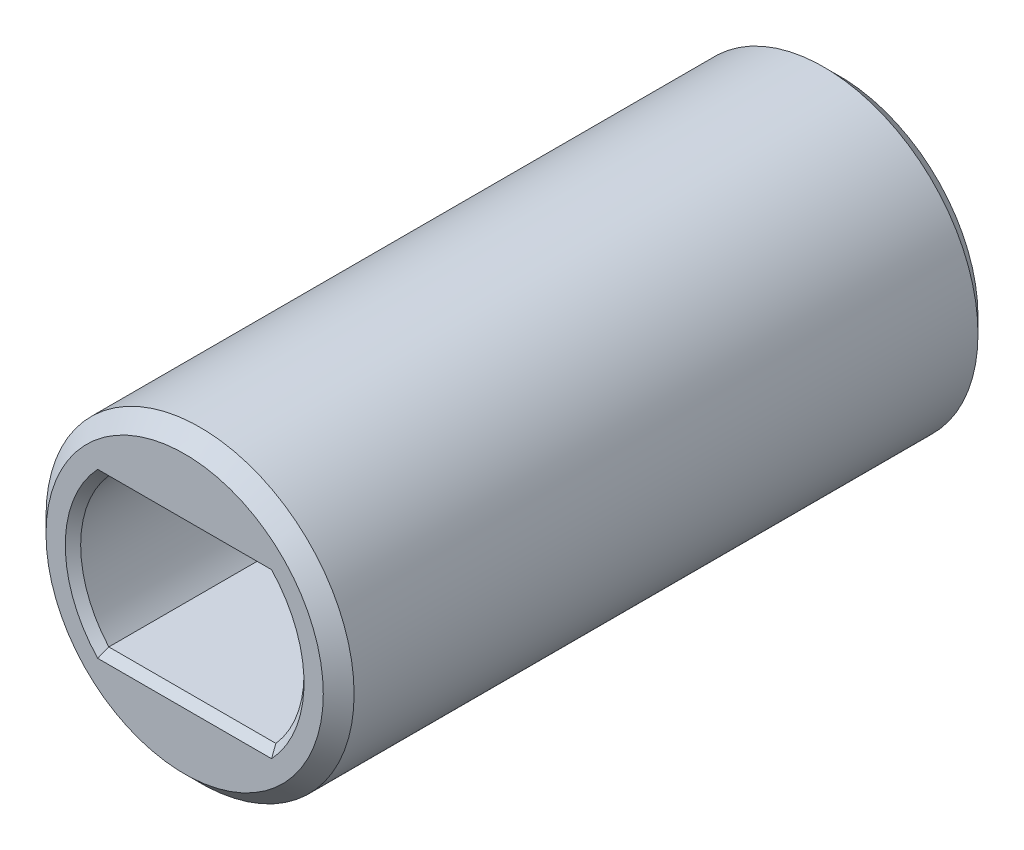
ISO-10303-21;
HEADER;
FILE_DESCRIPTION(('STEP AP214'),'2;1');
FILE_NAME('part.step','',(''),(''),'','','');
FILE_SCHEMA(('AUTOMOTIVE_DESIGN { 1 0 10303 214 1 1 1 1 }'));
ENDSEC;
DATA;
#1=APPLICATION_CONTEXT('core data for automotive mechanical design processes');
#2=APPLICATION_PROTOCOL_DEFINITION('international standard','automotive_design',2000,#1);
#3=PRODUCT_CONTEXT('',#1,'mechanical');
#4=PRODUCT('Part','Part','',(#3));
#5=PRODUCT_RELATED_PRODUCT_CATEGORY('part','',(#4));
#6=PRODUCT_DEFINITION_FORMATION('','',#4);
#7=PRODUCT_DEFINITION_CONTEXT('part definition',#1,'design');
#8=PRODUCT_DEFINITION('design','',#6,#7);
#9=PRODUCT_DEFINITION_SHAPE('','',#8);
#10=(LENGTH_UNIT() NAMED_UNIT(*) SI_UNIT(.MILLI.,.METRE.));
#11=(NAMED_UNIT(*) PLANE_ANGLE_UNIT() SI_UNIT($,.RADIAN.));
#12=(NAMED_UNIT(*) SI_UNIT($,.STERADIAN.) SOLID_ANGLE_UNIT());
#13=UNCERTAINTY_MEASURE_WITH_UNIT(LENGTH_MEASURE(1.E-05),#10,'distance_accuracy_value','');
#14=(GEOMETRIC_REPRESENTATION_CONTEXT(3) GLOBAL_UNCERTAINTY_ASSIGNED_CONTEXT((#13)) GLOBAL_UNIT_ASSIGNED_CONTEXT((#10,
#11,#12)) REPRESENTATION_CONTEXT('',''));
#15=CARTESIAN_POINT('',(0.,0.,0.));
#16=DIRECTION('',(0.,0.,1.));
#17=DIRECTION('',(1.,0.,0.));
#18=AXIS2_PLACEMENT_3D('',#15,#16,#17);
#19=CARTESIAN_POINT('',(0.,0.,-1.6));
#20=DIRECTION('',(0.,0.,-1.));
#21=DIRECTION('',(-1.,0.,0.));
#22=AXIS2_PLACEMENT_3D('',#19,#20,#21);
#23=CYLINDRICAL_SURFACE('',#22,1.9);
#24=CARTESIAN_POINT('',(0.,0.,-8.4));
#25=DIRECTION('',(0.,0.,-1.));
#26=DIRECTION('',(-1.,0.,0.));
#27=AXIS2_PLACEMENT_3D('',#24,#25,#26);
#28=CIRCLE('',#27,1.9);
#29=CARTESIAN_POINT('',(-1.9,0.,-8.4));
#30=VERTEX_POINT('',#29);
#31=EDGE_CURVE('E180',#30,#30,#28,.T.);
#32=ORIENTED_EDGE('',*,*,#31,.T.);
#33=EDGE_LOOP('',(#32));
#34=FACE_BOUND('',#33,.T.);
#35=DIRECTION('',(0.,0.,1.));
#36=VECTOR('',#35,1.);
#37=CARTESIAN_POINT('',(-1.54919333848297,-1.1,-6.8));
#38=LINE('',#37,#36);
#39=CARTESIAN_POINT('',(-1.54919333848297,-1.1,-6.8));
#40=VERTEX_POINT('',#39);
#41=CARTESIAN_POINT('',(-1.54919333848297,-1.1,-1.6));
#42=VERTEX_POINT('',#41);
#43=EDGE_CURVE('E47',#40,#42,#38,.T.);
#44=ORIENTED_EDGE('',*,*,#43,.F.);
#45=CARTESIAN_POINT('',(0.,0.,-6.8));
#46=DIRECTION('',(0.,0.,-1.));
#47=DIRECTION('',(-1.,0.,0.));
#48=AXIS2_PLACEMENT_3D('',#45,#46,#47);
#49=CIRCLE('',#48,1.9);
#50=CARTESIAN_POINT('',(1.54919333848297,-1.1,-6.8));
#51=VERTEX_POINT('',#50);
#52=EDGE_CURVE('E115',#51,#40,#49,.T.);
#53=ORIENTED_EDGE('',*,*,#52,.F.);
#54=DIRECTION('',(0.,0.,1.));
#55=VECTOR('',#54,1.);
#56=CARTESIAN_POINT('',(1.54919333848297,-1.1,-6.8));
#57=LINE('',#56,#55);
#58=CARTESIAN_POINT('',(1.54919333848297,-1.1,-1.6));
#59=VERTEX_POINT('',#58);
#60=EDGE_CURVE('E112',#51,#59,#57,.T.);
#61=ORIENTED_EDGE('',*,*,#60,.T.);
#62=CARTESIAN_POINT('',(0.,0.,-1.6));
#63=DIRECTION('',(0.,0.,-1.));
#64=DIRECTION('',(-1.,0.,0.));
#65=AXIS2_PLACEMENT_3D('',#62,#63,#64);
#66=CIRCLE('',#65,1.9);
#67=CARTESIAN_POINT('',(1.54919333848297,1.1,-1.6));
#68=VERTEX_POINT('',#67);
#69=EDGE_CURVE('E139',#68,#59,#66,.T.);
#70=ORIENTED_EDGE('',*,*,#69,.F.);
#71=DIRECTION('',(0.,0.,1.));
#72=VECTOR('',#71,1.);
#73=CARTESIAN_POINT('',(1.54919333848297,1.1,-6.8));
#74=LINE('',#73,#72);
#75=CARTESIAN_POINT('',(1.54919333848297,1.1,-6.8));
#76=VERTEX_POINT('',#75);
#77=EDGE_CURVE('E55',#76,#68,#74,.T.);
#78=ORIENTED_EDGE('',*,*,#77,.F.);
#79=CARTESIAN_POINT('',(0.,0.,-6.8));
#80=DIRECTION('',(0.,0.,-1.));
#81=DIRECTION('',(-1.,0.,0.));
#82=AXIS2_PLACEMENT_3D('',#79,#80,#81);
#83=CIRCLE('',#82,1.9);
#84=CARTESIAN_POINT('',(-1.54919333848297,1.1,-6.8));
#85=VERTEX_POINT('',#84);
#86=EDGE_CURVE('E126',#85,#76,#83,.T.);
#87=ORIENTED_EDGE('',*,*,#86,.F.);
#88=DIRECTION('',(0.,0.,1.));
#89=VECTOR('',#88,1.);
#90=CARTESIAN_POINT('',(-1.54919333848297,1.1,-6.8));
#91=LINE('',#90,#89);
#92=CARTESIAN_POINT('',(-1.54919333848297,1.1,-1.6));
#93=VERTEX_POINT('',#92);
#94=EDGE_CURVE('E134',#85,#93,#91,.T.);
#95=ORIENTED_EDGE('',*,*,#94,.T.);
#96=EDGE_CURVE('E123',#42,#93,#66,.T.);
#97=ORIENTED_EDGE('',*,*,#96,.F.);
#98=EDGE_LOOP('',(#44,#53,#61,#70,#78,#87,#95,#97));
#99=FACE_BOUND('',#98,.T.);
#100=ADVANCED_FACE('F32',(#34,#99),#23,.F.);
#101=CARTESIAN_POINT('',(0.,0.,-1.6));
#102=DIRECTION('',(0.,0.,-1.));
#103=DIRECTION('',(-1.,0.,0.));
#104=AXIS2_PLACEMENT_3D('',#101,#102,#103);
#105=PLANE('',#104);
#106=ORIENTED_EDGE('',*,*,#69,.T.);
#107=DIRECTION('',(1.,0.,0.));
#108=VECTOR('',#107,1.);
#109=CARTESIAN_POINT('',(1.54919333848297,-1.1,-1.6));
#110=LINE('',#109,#108);
#111=EDGE_CURVE('E119',#42,#59,#110,.T.);
#112=ORIENTED_EDGE('',*,*,#111,.F.);
#113=ORIENTED_EDGE('',*,*,#96,.T.);
#114=DIRECTION('',(-1.,0.,0.));
#115=VECTOR('',#114,1.);
#116=CARTESIAN_POINT('',(1.54919333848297,1.1,-1.6));
#117=LINE('',#116,#115);
#118=EDGE_CURVE('E124',#68,#93,#117,.T.);
#119=ORIENTED_EDGE('',*,*,#118,.F.);
#120=EDGE_LOOP('',(#106,#112,#113,#119));
#121=FACE_BOUND('',#120,.T.);
#122=ADVANCED_FACE('F242',(#121),#105,.T.);
#123=CARTESIAN_POINT('',(0.,0.,8.4));
#124=DIRECTION('',(0.,0.,1.));
#125=DIRECTION('',(1.,0.,0.));
#126=AXIS2_PLACEMENT_3D('',#123,#124,#125);
#127=PLANE('',#126);
#128=CARTESIAN_POINT('',(0.,0.,8.4));
#129=DIRECTION('',(0.,0.,1.));
#130=DIRECTION('',(1.,0.,0.));
#131=AXIS2_PLACEMENT_3D('',#128,#129,#130);
#132=CIRCLE('',#131,3.60000000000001);
#133=CARTESIAN_POINT('',(3.60000000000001,0.,8.4));
#134=VERTEX_POINT('',#133);
#135=EDGE_CURVE('E11',#134,#134,#132,.T.);
#136=ORIENTED_EDGE('',*,*,#135,.T.);
#137=EDGE_LOOP('',(#136));
#138=FACE_BOUND('',#137,.T.);
#139=DIRECTION('',(1.,0.,0.));
#140=VECTOR('',#139,1.);
#141=CARTESIAN_POINT('',(0.,2.125,8.4));
#142=LINE('',#141,#140);
#143=CARTESIAN_POINT('',(-2.25707221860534,2.125,8.4));
#144=VERTEX_POINT('',#143);
#145=CARTESIAN_POINT('',(2.25707221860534,2.125,8.4));
#146=VERTEX_POINT('',#145);
#147=EDGE_CURVE('E167',#144,#146,#142,.T.);
#148=ORIENTED_EDGE('',*,*,#147,.T.);
#149=CARTESIAN_POINT('',(0.,0.,8.4));
#150=DIRECTION('',(0.,0.,1.));
#151=DIRECTION('',(1.,0.,0.));
#152=AXIS2_PLACEMENT_3D('',#149,#150,#151);
#153=CIRCLE('',#152,3.10000000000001);
#154=CARTESIAN_POINT('',(2.25707221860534,-2.12500000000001,8.4));
#155=VERTEX_POINT('',#154);
#156=EDGE_CURVE('E171',#146,#155,#153,.F.);
#157=ORIENTED_EDGE('',*,*,#156,.T.);
#158=DIRECTION('',(-1.,0.,0.));
#159=VECTOR('',#158,1.);
#160=CARTESIAN_POINT('',(0.,-2.12500000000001,8.4));
#161=LINE('',#160,#159);
#162=CARTESIAN_POINT('',(-2.25707221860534,-2.125,8.4));
#163=VERTEX_POINT('',#162);
#164=EDGE_CURVE('E169',#155,#163,#161,.T.);
#165=ORIENTED_EDGE('',*,*,#164,.T.);
#166=CARTESIAN_POINT('',(0.,0.,8.4));
#167=DIRECTION('',(0.,0.,1.));
#168=DIRECTION('',(1.,0.,0.));
#169=AXIS2_PLACEMENT_3D('',#166,#167,#168);
#170=CIRCLE('',#169,3.1);
#171=EDGE_CURVE('E165',#163,#144,#170,.F.);
#172=ORIENTED_EDGE('',*,*,#171,.T.);
#173=EDGE_LOOP('',(#148,#157,#165,#172));
#174=FACE_BOUND('',#173,.T.);
#175=ADVANCED_FACE('F248',(#138,#174),#127,.T.);
#176=CARTESIAN_POINT('',(0.,0.,8.4));
#177=DIRECTION('',(0.,0.,-1.));
#178=DIRECTION('',(-1.,0.,0.));
#179=AXIS2_PLACEMENT_3D('',#176,#177,#178);
#180=CYLINDRICAL_SURFACE('',#179,4.);
#181=CARTESIAN_POINT('',(0.,0.,-8.2));
#182=DIRECTION('',(0.,0.,-1.));
#183=DIRECTION('',(-1.,0.,0.));
#184=AXIS2_PLACEMENT_3D('',#181,#182,#183);
#185=CIRCLE('',#184,4.);
#186=CARTESIAN_POINT('',(-4.,0.,-8.2));
#187=VERTEX_POINT('',#186);
#188=EDGE_CURVE('E40',#187,#187,#185,.F.);
#189=ORIENTED_EDGE('',*,*,#188,.T.);
#190=EDGE_LOOP('',(#189));
#191=FACE_BOUND('',#190,.T.);
#192=CARTESIAN_POINT('',(0.,0.,8.));
#193=DIRECTION('',(0.,0.,1.));
#194=DIRECTION('',(1.,0.,0.));
#195=AXIS2_PLACEMENT_3D('',#192,#193,#194);
#196=CIRCLE('',#195,4.);
#197=CARTESIAN_POINT('',(4.,0.,8.));
#198=VERTEX_POINT('',#197);
#199=EDGE_CURVE('E287',#198,#198,#196,.F.);
#200=ORIENTED_EDGE('',*,*,#199,.T.);
#201=EDGE_LOOP('',(#200));
#202=FACE_BOUND('',#201,.T.);
#203=ADVANCED_FACE('F275',(#191,#202),#180,.T.);
#204=CARTESIAN_POINT('',(0.,0.,8.4));
#205=DIRECTION('',(0.,0.,-1.));
#206=DIRECTION('',(-1.,0.,0.));
#207=AXIS2_PLACEMENT_3D('',#204,#205,#206);
#208=CYLINDRICAL_SURFACE('',#207,2.9);
#209=DIRECTION('',(0.,0.,-1.));
#210=VECTOR('',#209,1.);
#211=CARTESIAN_POINT('',(-2.1689571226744,1.925,8.4));
#212=LINE('',#211,#210);
#213=CARTESIAN_POINT('',(-2.1689571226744,1.925,8.2));
#214=VERTEX_POINT('',#213);
#215=CARTESIAN_POINT('',(-2.1689571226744,1.925,0.));
#216=VERTEX_POINT('',#215);
#217=EDGE_CURVE('E154',#214,#216,#212,.T.);
#218=ORIENTED_EDGE('',*,*,#217,.F.);
#219=CARTESIAN_POINT('',(0.,0.,8.2));
#220=DIRECTION('',(0.,0.,1.));
#221=DIRECTION('',(1.,0.,0.));
#222=AXIS2_PLACEMENT_3D('',#219,#220,#221);
#223=CIRCLE('',#222,2.9);
#224=CARTESIAN_POINT('',(-2.1689571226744,-1.925,8.2));
#225=VERTEX_POINT('',#224);
#226=EDGE_CURVE('E178',#214,#225,#223,.T.);
#227=ORIENTED_EDGE('',*,*,#226,.T.);
#228=DIRECTION('',(0.,0.,-1.));
#229=VECTOR('',#228,1.);
#230=CARTESIAN_POINT('',(-2.1689571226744,-1.925,8.4));
#231=LINE('',#230,#229);
#232=CARTESIAN_POINT('',(-2.1689571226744,-1.925,0.));
#233=VERTEX_POINT('',#232);
#234=EDGE_CURVE('E160',#225,#233,#231,.T.);
#235=ORIENTED_EDGE('',*,*,#234,.T.);
#236=CARTESIAN_POINT('',(0.,0.,0.));
#237=DIRECTION('',(0.,0.,1.));
#238=DIRECTION('',(1.,0.,0.));
#239=AXIS2_PLACEMENT_3D('',#236,#237,#238);
#240=CIRCLE('',#239,2.9);
#241=EDGE_CURVE('E142',#216,#233,#240,.T.);
#242=ORIENTED_EDGE('',*,*,#241,.F.);
#243=EDGE_LOOP('',(#218,#227,#235,#242));
#244=FACE_BOUND('',#243,.T.);
#245=ADVANCED_FACE('F271',(#244),#208,.F.);
#246=CARTESIAN_POINT('',(-2.1689571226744,-1.925,8.4));
#247=DIRECTION('',(0.,1.,0.));
#248=DIRECTION('',(-1.,0.,0.));
#249=AXIS2_PLACEMENT_3D('',#246,#247,#248);
#250=PLANE('',#249);
#251=ORIENTED_EDGE('',*,*,#234,.F.);
#252=DIRECTION('',(1.,0.,0.));
#253=VECTOR('',#252,1.);
#254=CARTESIAN_POINT('',(-2.1689571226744,-1.925,8.2));
#255=LINE('',#254,#253);
#256=CARTESIAN_POINT('',(2.1689571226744,-1.925,8.2));
#257=VERTEX_POINT('',#256);
#258=EDGE_CURVE('E174',#225,#257,#255,.T.);
#259=ORIENTED_EDGE('',*,*,#258,.T.);
#260=DIRECTION('',(0.,0.,-1.));
#261=VECTOR('',#260,1.);
#262=CARTESIAN_POINT('',(2.1689571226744,-1.925,8.4));
#263=LINE('',#262,#261);
#264=CARTESIAN_POINT('',(2.1689571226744,-1.925,0.));
#265=VERTEX_POINT('',#264);
#266=EDGE_CURVE('E158',#257,#265,#263,.T.);
#267=ORIENTED_EDGE('',*,*,#266,.T.);
#268=DIRECTION('',(1.,0.,0.));
#269=VECTOR('',#268,1.);
#270=CARTESIAN_POINT('',(-2.1689571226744,-1.925,0.));
#271=LINE('',#270,#269);
#272=EDGE_CURVE('E145',#233,#265,#271,.T.);
#273=ORIENTED_EDGE('',*,*,#272,.F.);
#274=EDGE_LOOP('',(#251,#259,#267,#273));
#275=FACE_BOUND('',#274,.T.);
#276=ADVANCED_FACE('F267',(#275),#250,.T.);
#277=CARTESIAN_POINT('',(0.,0.,8.4));
#278=DIRECTION('',(0.,0.,-1.));
#279=DIRECTION('',(-1.,0.,0.));
#280=AXIS2_PLACEMENT_3D('',#277,#278,#279);
#281=CYLINDRICAL_SURFACE('',#280,2.9);
#282=ORIENTED_EDGE('',*,*,#266,.F.);
#283=CARTESIAN_POINT('',(0.,0.,8.2));
#284=DIRECTION('',(0.,0.,1.));
#285=DIRECTION('',(1.,0.,0.));
#286=AXIS2_PLACEMENT_3D('',#283,#284,#285);
#287=CIRCLE('',#286,2.9);
#288=CARTESIAN_POINT('',(2.1689571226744,1.925,8.2));
#289=VERTEX_POINT('',#288);
#290=EDGE_CURVE('E162',#257,#289,#287,.T.);
#291=ORIENTED_EDGE('',*,*,#290,.T.);
#292=DIRECTION('',(0.,0.,-1.));
#293=VECTOR('',#292,1.);
#294=CARTESIAN_POINT('',(2.1689571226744,1.925,8.4));
#295=LINE('',#294,#293);
#296=CARTESIAN_POINT('',(2.1689571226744,1.925,0.));
#297=VERTEX_POINT('',#296);
#298=EDGE_CURVE('E156',#289,#297,#295,.T.);
#299=ORIENTED_EDGE('',*,*,#298,.T.);
#300=CARTESIAN_POINT('',(0.,0.,0.));
#301=DIRECTION('',(0.,0.,1.));
#302=DIRECTION('',(1.,0.,0.));
#303=AXIS2_PLACEMENT_3D('',#300,#301,#302);
#304=CIRCLE('',#303,2.9);
#305=EDGE_CURVE('E148',#265,#297,#304,.T.);
#306=ORIENTED_EDGE('',*,*,#305,.F.);
#307=EDGE_LOOP('',(#282,#291,#299,#306));
#308=FACE_BOUND('',#307,.T.);
#309=ADVANCED_FACE('F263',(#308),#281,.F.);
#310=CARTESIAN_POINT('',(-2.1689571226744,1.925,8.4));
#311=DIRECTION('',(0.,-1.,0.));
#312=DIRECTION('',(1.,0.,0.));
#313=AXIS2_PLACEMENT_3D('',#310,#311,#312);
#314=PLANE('',#313);
#315=ORIENTED_EDGE('',*,*,#298,.F.);
#316=DIRECTION('',(-1.,0.,0.));
#317=VECTOR('',#316,1.);
#318=CARTESIAN_POINT('',(-2.1689571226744,1.925,8.2));
#319=LINE('',#318,#317);
#320=EDGE_CURVE('E176',#289,#214,#319,.T.);
#321=ORIENTED_EDGE('',*,*,#320,.T.);
#322=ORIENTED_EDGE('',*,*,#217,.T.);
#323=DIRECTION('',(-1.,0.,0.));
#324=VECTOR('',#323,1.);
#325=CARTESIAN_POINT('',(-2.1689571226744,1.925,0.));
#326=LINE('',#325,#324);
#327=EDGE_CURVE('E151',#297,#216,#326,.T.);
#328=ORIENTED_EDGE('',*,*,#327,.F.);
#329=EDGE_LOOP('',(#315,#321,#322,#328));
#330=FACE_BOUND('',#329,.T.);
#331=ADVANCED_FACE('F259',(#330),#314,.T.);
#332=CARTESIAN_POINT('',(0.,0.,0.));
#333=DIRECTION('',(0.,0.,-1.));
#334=DIRECTION('',(-1.,0.,0.));
#335=AXIS2_PLACEMENT_3D('',#332,#333,#334);
#336=PLANE('',#335);
#337=ORIENTED_EDGE('',*,*,#241,.T.);
#338=ORIENTED_EDGE('',*,*,#272,.T.);
#339=ORIENTED_EDGE('',*,*,#305,.T.);
#340=ORIENTED_EDGE('',*,*,#327,.T.);
#341=EDGE_LOOP('',(#337,#338,#339,#340));
#342=FACE_BOUND('',#341,.T.);
#343=ADVANCED_FACE('F255',(#342),#336,.F.);
#344=CARTESIAN_POINT('',(0.,0.,-8.6));
#345=DIRECTION('',(0.,0.,-1.));
#346=DIRECTION('',(-1.,0.,0.));
#347=AXIS2_PLACEMENT_3D('',#344,#345,#346);
#348=PLANE('',#347);
#349=CARTESIAN_POINT('',(0.,0.,-8.6));
#350=DIRECTION('',(0.,0.,-1.));
#351=DIRECTION('',(-1.,0.,0.));
#352=AXIS2_PLACEMENT_3D('',#349,#350,#351);
#353=CIRCLE('',#352,3.6);
#354=CARTESIAN_POINT('',(-3.6,0.,-8.6));
#355=VERTEX_POINT('',#354);
#356=EDGE_CURVE('E186',#355,#355,#353,.T.);
#357=ORIENTED_EDGE('',*,*,#356,.T.);
#358=EDGE_LOOP('',(#357));
#359=FACE_BOUND('',#358,.T.);
#360=CARTESIAN_POINT('',(0.,0.,-8.6));
#361=DIRECTION('',(0.,0.,-1.));
#362=DIRECTION('',(-1.,0.,0.));
#363=AXIS2_PLACEMENT_3D('',#360,#361,#362);
#364=CIRCLE('',#363,2.1);
#365=CARTESIAN_POINT('',(-2.1,0.,-8.6));
#366=VERTEX_POINT('',#365);
#367=EDGE_CURVE('E183',#366,#366,#364,.F.);
#368=ORIENTED_EDGE('',*,*,#367,.T.);
#369=EDGE_LOOP('',(#368));
#370=FACE_BOUND('',#369,.T.);
#371=ADVANCED_FACE('F225',(#359,#370),#348,.T.);
#372=CARTESIAN_POINT('',(0.,0.,8.2));
#373=DIRECTION('',(0.,0.,1.));
#374=DIRECTION('',(1.,0.,0.));
#375=AXIS2_PLACEMENT_3D('',#372,#373,#374);
#376=CONICAL_SURFACE('',#375,2.9,0.785398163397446);
#377=CARTESIAN_POINT('',(-2.1689571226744,1.925,8.2));
#378=CARTESIAN_POINT('',(-2.18390946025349,1.95827463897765,8.23327463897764));
#379=CARTESIAN_POINT('',(-2.19872855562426,1.99157862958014,8.26657862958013));
#380=CARTESIAN_POINT('',(-2.22810025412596,2.05824529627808,8.33324529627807));
#381=CARTESIAN_POINT('',(-2.24265285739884,2.09160797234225,8.36660797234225));
#382=CARTESIAN_POINT('',(-2.25707221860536,2.125,8.4));
#383=B_SPLINE_CURVE_WITH_KNOTS('',3,(#377,#378,#379,#380,#381,#382),.UNSPECIFIED.,.F.,.F.,(4,2,
4),(0.,0.148125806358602,0.296251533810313),.UNSPECIFIED.);
#384=EDGE_CURVE('E210',#144,#214,#383,.F.);
#385=ORIENTED_EDGE('',*,*,#384,.F.);
#386=ORIENTED_EDGE('',*,*,#171,.F.);
#387=CARTESIAN_POINT('',(-2.25707221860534,-2.12500000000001,8.4));
#388=CARTESIAN_POINT('',(-2.24265285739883,-2.09160797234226,8.36660797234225));
#389=CARTESIAN_POINT('',(-2.22810025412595,-2.05824529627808,8.33324529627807));
#390=CARTESIAN_POINT('',(-2.19872855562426,-1.99157862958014,8.26657862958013));
#391=CARTESIAN_POINT('',(-2.1839094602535,-1.95827463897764,8.23327463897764));
#392=CARTESIAN_POINT('',(-2.16895712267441,-1.925,8.19999999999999));
#393=B_SPLINE_CURVE_WITH_KNOTS('',3,(#387,#388,#389,#390,#391,#392),.UNSPECIFIED.,.F.,.F.,(4,2,
4),(0.,0.148125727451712,0.296251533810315),.UNSPECIFIED.);
#394=EDGE_CURVE('E216',#225,#163,#393,.F.);
#395=ORIENTED_EDGE('',*,*,#394,.F.);
#396=ORIENTED_EDGE('',*,*,#226,.F.);
#397=EDGE_LOOP('',(#385,#386,#395,#396));
#398=FACE_BOUND('',#397,.T.);
#399=ADVANCED_FACE('F221',(#398),#376,.F.);
#400=CARTESIAN_POINT('',(-2.1689571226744,-1.925,8.2));
#401=DIRECTION('',(0.,-0.707106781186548,-0.707106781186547));
#402=DIRECTION('',(1.,0.,0.));
#403=AXIS2_PLACEMENT_3D('',#400,#401,#402);
#404=PLANE('',#403);
#405=ORIENTED_EDGE('',*,*,#394,.T.);
#406=ORIENTED_EDGE('',*,*,#164,.F.);
#407=CARTESIAN_POINT('',(2.25707221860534,-2.125,8.4));
#408=CARTESIAN_POINT('',(2.24265285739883,-2.09160797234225,8.36660797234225));
#409=CARTESIAN_POINT('',(2.22810025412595,-2.05824529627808,8.33324529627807));
#410=CARTESIAN_POINT('',(2.19872855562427,-1.99157862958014,8.26657862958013));
#411=CARTESIAN_POINT('',(2.18390946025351,-1.95827463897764,8.23327463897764));
#412=CARTESIAN_POINT('',(2.16895712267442,-1.925,8.19999999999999));
#413=B_SPLINE_CURVE_WITH_KNOTS('',3,(#407,#408,#409,#410,#411,#412),.UNSPECIFIED.,.F.,.F.,(4,2,
4),(0.,0.148125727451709,0.296251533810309),.UNSPECIFIED.);
#414=EDGE_CURVE('E193',#257,#155,#413,.F.);
#415=ORIENTED_EDGE('',*,*,#414,.F.);
#416=ORIENTED_EDGE('',*,*,#258,.F.);
#417=EDGE_LOOP('',(#405,#406,#415,#416));
#418=FACE_BOUND('',#417,.T.);
#419=ADVANCED_FACE('F205',(#418),#404,.F.);
#420=CARTESIAN_POINT('',(-2.1689571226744,1.925,8.2));
#421=DIRECTION('',(0.,0.707106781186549,-0.707106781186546));
#422=DIRECTION('',(-1.,0.,0.));
#423=AXIS2_PLACEMENT_3D('',#420,#421,#422);
#424=PLANE('',#423);
#425=ORIENTED_EDGE('',*,*,#384,.T.);
#426=ORIENTED_EDGE('',*,*,#320,.F.);
#427=CARTESIAN_POINT('',(2.1689571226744,1.925,8.2));
#428=CARTESIAN_POINT('',(2.18390946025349,1.95827463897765,8.23327463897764));
#429=CARTESIAN_POINT('',(2.19872855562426,1.99157862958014,8.26657862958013));
#430=CARTESIAN_POINT('',(2.22810025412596,2.05824529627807,8.33324529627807));
#431=CARTESIAN_POINT('',(2.24265285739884,2.09160797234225,8.36660797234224));
#432=CARTESIAN_POINT('',(2.25707221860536,2.125,8.4));
#433=B_SPLINE_CURVE_WITH_KNOTS('',3,(#427,#428,#429,#430,#431,#432),.UNSPECIFIED.,.F.,.F.,(4,2,
4),(0.,0.1481258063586,0.296251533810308),.UNSPECIFIED.);
#434=EDGE_CURVE('E138',#146,#289,#433,.F.);
#435=ORIENTED_EDGE('',*,*,#434,.F.);
#436=ORIENTED_EDGE('',*,*,#147,.F.);
#437=EDGE_LOOP('',(#425,#426,#435,#436));
#438=FACE_BOUND('',#437,.T.);
#439=ADVANCED_FACE('F202',(#438),#424,.F.);
#440=CARTESIAN_POINT('',(0.,0.,8.2));
#441=DIRECTION('',(0.,0.,1.));
#442=DIRECTION('',(1.,0.,0.));
#443=AXIS2_PLACEMENT_3D('',#440,#441,#442);
#444=CONICAL_SURFACE('',#443,2.9,0.785398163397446);
#445=ORIENTED_EDGE('',*,*,#414,.T.);
#446=ORIENTED_EDGE('',*,*,#156,.F.);
#447=ORIENTED_EDGE('',*,*,#434,.T.);
#448=ORIENTED_EDGE('',*,*,#290,.F.);
#449=EDGE_LOOP('',(#445,#446,#447,#448));
#450=FACE_BOUND('',#449,.T.);
#451=ADVANCED_FACE('F199',(#450),#444,.F.);
#452=CARTESIAN_POINT('',(0.,0.,-8.4));
#453=DIRECTION('',(0.,0.,-1.));
#454=DIRECTION('',(-1.,0.,0.));
#455=AXIS2_PLACEMENT_3D('',#452,#453,#454);
#456=CONICAL_SURFACE('',#455,1.9,0.785398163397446);
#457=ORIENTED_EDGE('',*,*,#367,.F.);
#458=EDGE_LOOP('',(#457));
#459=FACE_BOUND('',#458,.T.);
#460=ORIENTED_EDGE('',*,*,#31,.F.);
#461=EDGE_LOOP('',(#460));
#462=FACE_BOUND('',#461,.T.);
#463=ADVANCED_FACE('F227',(#459,#462),#456,.F.);
#464=CARTESIAN_POINT('',(0.,0.,-8.6));
#465=DIRECTION('',(0.,0.,1.));
#466=DIRECTION('',(1.,0.,0.));
#467=AXIS2_PLACEMENT_3D('',#464,#465,#466);
#468=CONICAL_SURFACE('',#467,3.6,0.785398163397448);
#469=ORIENTED_EDGE('',*,*,#188,.F.);
#470=EDGE_LOOP('',(#469));
#471=FACE_BOUND('',#470,.T.);
#472=ORIENTED_EDGE('',*,*,#356,.F.);
#473=EDGE_LOOP('',(#472));
#474=FACE_BOUND('',#473,.T.);
#475=ADVANCED_FACE('F230',(#471,#474),#468,.T.);
#476=CARTESIAN_POINT('',(0.,0.,8.4));
#477=DIRECTION('',(0.,0.,-1.));
#478=DIRECTION('',(-1.,0.,0.));
#479=AXIS2_PLACEMENT_3D('',#476,#477,#478);
#480=CONICAL_SURFACE('',#479,3.60000000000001,0.785398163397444);
#481=ORIENTED_EDGE('',*,*,#199,.F.);
#482=EDGE_LOOP('',(#481));
#483=FACE_BOUND('',#482,.T.);
#484=ORIENTED_EDGE('',*,*,#135,.F.);
#485=EDGE_LOOP('',(#484));
#486=FACE_BOUND('',#485,.T.);
#487=ADVANCED_FACE('F34',(#483,#486),#480,.T.);
#488=CARTESIAN_POINT('',(1.54919333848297,1.1,-6.8));
#489=DIRECTION('',(0.,1.,0.));
#490=DIRECTION('',(0.,0.,1.));
#491=AXIS2_PLACEMENT_3D('',#488,#489,#490);
#492=PLANE('',#491);
#493=ORIENTED_EDGE('',*,*,#118,.T.);
#494=ORIENTED_EDGE('',*,*,#94,.F.);
#495=DIRECTION('',(-1.,0.,0.));
#496=VECTOR('',#495,1.);
#497=CARTESIAN_POINT('',(1.54919333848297,1.1,-6.8));
#498=LINE('',#497,#496);
#499=EDGE_CURVE('E133',#76,#85,#498,.T.);
#500=ORIENTED_EDGE('',*,*,#499,.F.);
#501=ORIENTED_EDGE('',*,*,#77,.T.);
#502=EDGE_LOOP('',(#493,#494,#500,#501));
#503=FACE_BOUND('',#502,.T.);
#504=ADVANCED_FACE('F237',(#503),#492,.F.);
#505=CARTESIAN_POINT('',(0.,0.,-6.8));
#506=DIRECTION('',(0.,0.,-1.));
#507=DIRECTION('',(-1.,0.,0.));
#508=AXIS2_PLACEMENT_3D('',#505,#506,#507);
#509=PLANE('',#508);
#510=ORIENTED_EDGE('',*,*,#86,.T.);
#511=ORIENTED_EDGE('',*,*,#499,.T.);
#512=EDGE_LOOP('',(#510,#511));
#513=FACE_BOUND('',#512,.T.);
#514=ADVANCED_FACE('F325',(#513),#509,.T.);
#515=CARTESIAN_POINT('',(1.54919333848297,-1.1,-6.8));
#516=DIRECTION('',(0.,-1.,0.));
#517=DIRECTION('',(0.,0.,-1.));
#518=AXIS2_PLACEMENT_3D('',#515,#516,#517);
#519=PLANE('',#518);
#520=ORIENTED_EDGE('',*,*,#111,.T.);
#521=ORIENTED_EDGE('',*,*,#60,.F.);
#522=DIRECTION('',(1.,0.,0.));
#523=VECTOR('',#522,1.);
#524=CARTESIAN_POINT('',(1.54919333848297,-1.1,-6.8));
#525=LINE('',#524,#523);
#526=EDGE_CURVE('E108',#40,#51,#525,.T.);
#527=ORIENTED_EDGE('',*,*,#526,.F.);
#528=ORIENTED_EDGE('',*,*,#43,.T.);
#529=EDGE_LOOP('',(#520,#521,#527,#528));
#530=FACE_BOUND('',#529,.T.);
#531=ADVANCED_FACE('F110',(#530),#519,.F.);
#532=CARTESIAN_POINT('',(0.,0.,-6.8));
#533=DIRECTION('',(0.,0.,-1.));
#534=DIRECTION('',(-1.,0.,0.));
#535=AXIS2_PLACEMENT_3D('',#532,#533,#534);
#536=PLANE('',#535);
#537=ORIENTED_EDGE('',*,*,#52,.T.);
#538=ORIENTED_EDGE('',*,*,#526,.T.);
#539=EDGE_LOOP('',(#537,#538));
#540=FACE_BOUND('',#539,.T.);
#541=ADVANCED_FACE('F117',(#540),#536,.T.);
#542=CLOSED_SHELL('',(#100,#122,#175,#203,#245,#276,#309,#331,#343,#371,#399,#419,#439,#451,
#463,#475,#487,#504,#514,#531,#541));
#543=MANIFOLD_SOLID_BREP('B2',#542);
#544=ADVANCED_BREP_SHAPE_REPRESENTATION('',(#18,#543),#14);
#545=SHAPE_DEFINITION_REPRESENTATION(#9,#544);
ENDSEC;
END-ISO-10303-21;
